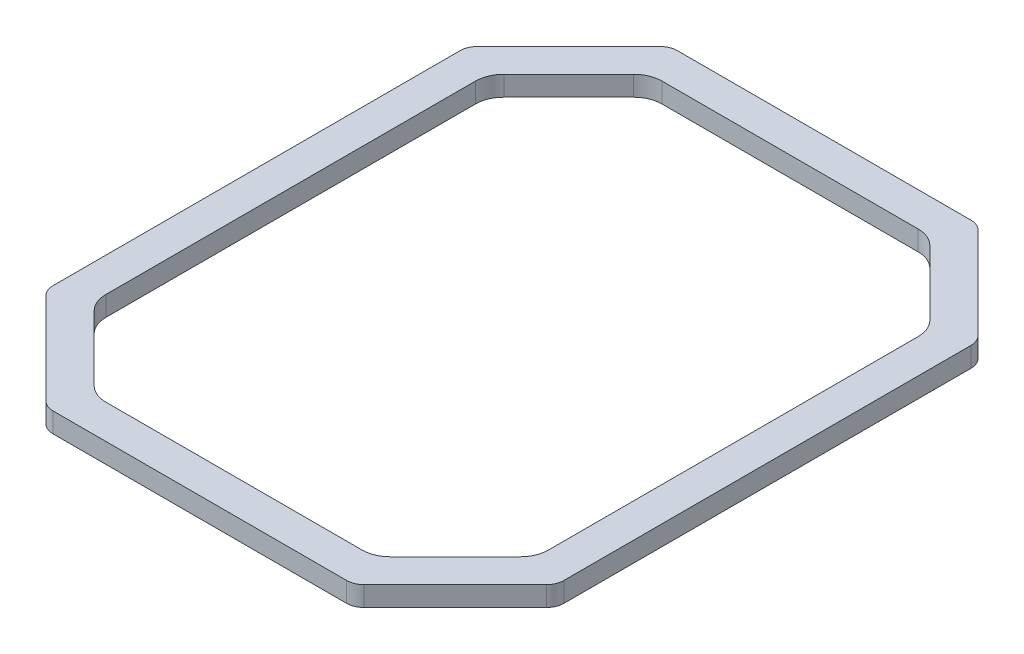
from build123d import *

# Parameters (mm, degrees)
BOSS_EXTRUDE1_DEPTH = 1.75


with BuildPart() as part:
    # Sketch1 → Boss-Extrude1 (new body)
    with BuildSketch(Plane(origin=(-905.783657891, 0, -1752.480725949), x_dir=(1, 0, 0), z_dir=(0, 1, 0))):
        with BuildLine():
            Line((5.86809467, -21.289791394), (-2.192922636, -29.3508087))
            ThreePointArc((-2.192922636, -29.3508087), (-2.518081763, -29.837443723), (-2.632262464, -30.411468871))
            Line((-2.632262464, -30.411468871), (-2.632262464, -66.28943426))
            ThreePointArc((-2.632262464, -66.28943426), (-2.518081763, -66.863459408), (-2.192922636, -67.350094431))
            Line((-2.192922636, -67.350094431), (5.86809467, -75.411111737))
            ThreePointArc((5.86809467, -75.411111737), (6.354729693, -75.736270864), (6.928754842, -75.850451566))
            Line((6.928754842, -75.850451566), (32.80672023, -75.850451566))
            ThreePointArc((32.80672023, -75.850451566), (33.380745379, -75.736270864), (33.867380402, -75.411111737))
            Line((33.867380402, -75.411111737), (41.928397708, -67.350094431))
            ThreePointArc((41.928397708, -67.350094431), (42.253556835, -66.863459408), (42.367737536, -66.28943426))
            Line((42.367737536, -66.28943426), (42.367737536, -30.411468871))
            ThreePointArc((42.367737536, -30.411468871), (42.253556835, -29.837443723), (41.928397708, -29.3508087))
            Line((41.928397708, -29.3508087), (33.867380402, -21.289791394))
            ThreePointArc((33.867380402, -21.289791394), (33.380745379, -20.964632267), (32.80672023, -20.850451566))
            Line((32.80672023, -20.850451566), (6.928754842, -20.850451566))
            ThreePointArc((6.928754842, -20.850451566), (6.354729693, -20.964632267), (5.86809467, -21.289791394))
        make_face()
        with BuildLine():
            Line((6.817842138, -24.582684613), (1.099970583, -30.300556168))
            ThreePointArc((1.099970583, -30.300556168), (0.558038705, -31.11161454), (0.367737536, -32.068323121))
            Line((0.367737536, -32.068323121), (0.367737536, -64.63258001))
            ThreePointArc((0.367737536, -64.63258001), (0.558038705, -65.589288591), (1.099970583, -66.400346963))
            Line((1.099970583, -66.400346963), (6.817842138, -72.118218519))
            ThreePointArc((6.817842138, -72.118218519), (7.62890051, -72.660150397), (8.585609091, -72.850451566))
            Line((8.585609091, -72.850451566), (31.149865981, -72.850451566))
            ThreePointArc((31.149865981, -72.850451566), (32.106574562, -72.660150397), (32.917632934, -72.118218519))
            Line((32.917632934, -72.118218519), (38.635504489, -66.400346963))
            ThreePointArc((38.635504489, -66.400346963), (39.177436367, -65.589288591), (39.367737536, -64.63258001))
            Line((39.367737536, -64.63258001), (39.367737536, -32.068323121))
            ThreePointArc((39.367737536, -32.068323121), (39.177436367, -31.11161454), (38.635504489, -30.300556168))
            Line((38.635504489, -30.300556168), (32.917632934, -24.582684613))
            ThreePointArc((32.917632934, -24.582684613), (32.106574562, -24.040752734), (31.149865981, -23.850451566))
            Line((31.149865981, -23.850451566), (8.585609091, -23.850451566))
            ThreePointArc((8.585609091, -23.850451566), (7.62890051, -24.040752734), (6.817842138, -24.582684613))
        make_face(mode=Mode.SUBTRACT)
    extrude(amount=BOSS_EXTRUDE1_DEPTH)


solid = part.part
